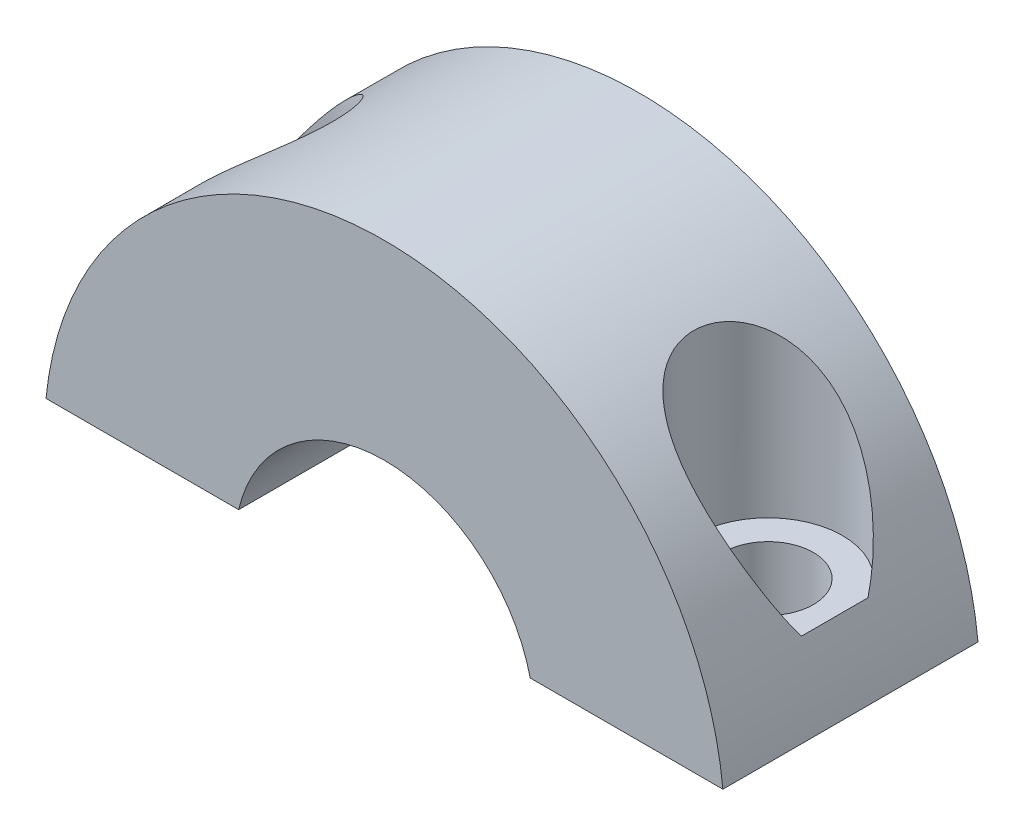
from build123d import *

# Parameters (mm, degrees)
BOSS_EXTRUDE1_DEPTH                              = 19.05
CBORE_FOR_1_4_SOCKET_HEAD_CAP_SCREW2_D           = 6.7564
CBORE_FOR_1_4_SOCKET_HEAD_CAP_SCREW2_CBORE_D     = 11.1125
CBORE_FOR_1_4_SOCKET_HEAD_CAP_SCREW2_CBORE_DEPTH = 20.32


with BuildPart() as part:
    # Sketch1 → Boss-Extrude1 (new body)
    with BuildSketch(Plane.XY):
        with BuildLine():
            Line((-25.272680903, 2.54), (-10.883536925, 2.54))
            ThreePointArc((-10.883536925, 2.54), (0, 11.176), (10.883536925, 2.54))
            Line((10.883536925, 2.54), (25.272680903, 2.54))
            ThreePointArc((25.272680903, 2.54), (0, 25.4), (-25.272680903, 2.54))
        make_face()
    extrude(amount=BOSS_EXTRUDE1_DEPTH)

    # CBORE for 1_4 Socket Head Cap Screw2 (through all)
    with Locations(Plane(origin=(0, 28.575, 0), x_dir=(1, 0, 0), z_dir=(0, 1, 0))):
        with Locations((19.05, -9.4488), (-19.05, -9.4488)):
            CounterBoreHole(CBORE_FOR_1_4_SOCKET_HEAD_CAP_SCREW2_D / 2, CBORE_FOR_1_4_SOCKET_HEAD_CAP_SCREW2_CBORE_D / 2, CBORE_FOR_1_4_SOCKET_HEAD_CAP_SCREW2_CBORE_DEPTH)


solid = part.part
